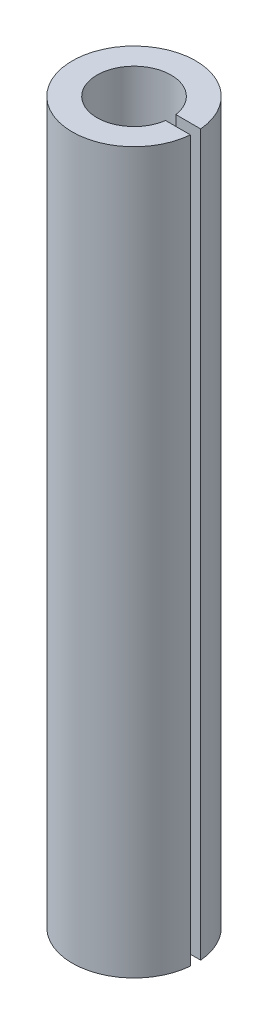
from build123d import *

# Parameters (mm, degrees)
BASE_EXTRUSION_DEPTH = 17.5


with BuildPart() as part:
    # Esquisse1 → Base-Extrusion (new, symmetric)
    with BuildSketch(Plane(origin=(0, 0, 0), x_dir=(1, 0, 0), z_dir=(0, 1, 0))):
        with BuildLine():
            Line((1.782554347, 0.25), (2.989565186, 0.25))
            ThreePointArc((2.989565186, 0.25), (-3, 0), (2.989565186, -0.25))
            Line((2.989565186, -0.25), (1.782554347, -0.25))
            ThreePointArc((1.782554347, -0.25), (-1.8, 0), (1.782554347, 0.25))
        make_face()
    extrude(amount=BASE_EXTRUSION_DEPTH, both=True)


solid = part.part
